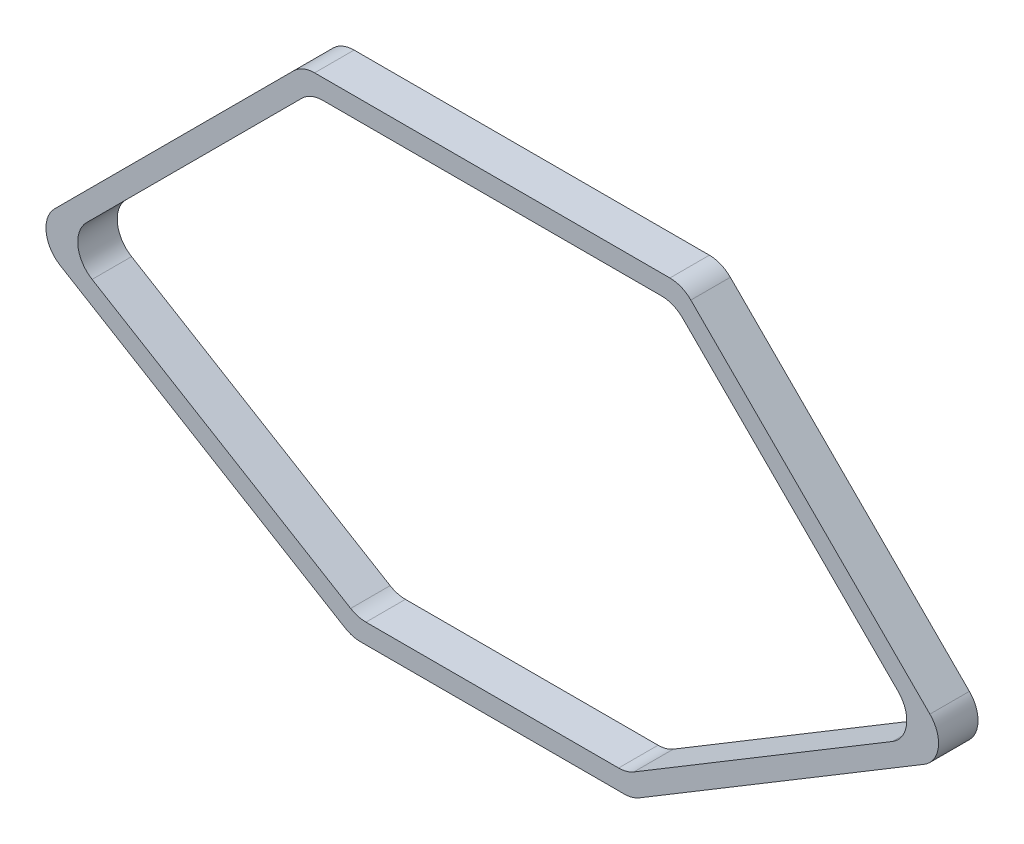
ISO-10303-21;
HEADER;
FILE_DESCRIPTION(('STEP AP214'),'2;1');
FILE_NAME('part.step','',(''),(''),'','','');
FILE_SCHEMA(('AUTOMOTIVE_DESIGN { 1 0 10303 214 1 1 1 1 }'));
ENDSEC;
DATA;
#1=APPLICATION_CONTEXT('core data for automotive mechanical design processes');
#2=APPLICATION_PROTOCOL_DEFINITION('international standard','automotive_design',2000,#1);
#3=PRODUCT_CONTEXT('',#1,'mechanical');
#4=PRODUCT('Part','Part','',(#3));
#5=PRODUCT_RELATED_PRODUCT_CATEGORY('part','',(#4));
#6=PRODUCT_DEFINITION_FORMATION('','',#4);
#7=PRODUCT_DEFINITION_CONTEXT('part definition',#1,'design');
#8=PRODUCT_DEFINITION('design','',#6,#7);
#9=PRODUCT_DEFINITION_SHAPE('','',#8);
#10=(LENGTH_UNIT() NAMED_UNIT(*) SI_UNIT(.MILLI.,.METRE.));
#11=(NAMED_UNIT(*) PLANE_ANGLE_UNIT() SI_UNIT($,.RADIAN.));
#12=(NAMED_UNIT(*) SI_UNIT($,.STERADIAN.) SOLID_ANGLE_UNIT());
#13=UNCERTAINTY_MEASURE_WITH_UNIT(LENGTH_MEASURE(1.E-05),#10,'distance_accuracy_value','');
#14=(GEOMETRIC_REPRESENTATION_CONTEXT(3) GLOBAL_UNCERTAINTY_ASSIGNED_CONTEXT((#13)) GLOBAL_UNIT_ASSIGNED_CONTEXT((#10,
#11,#12)) REPRESENTATION_CONTEXT('',''));
#15=CARTESIAN_POINT('',(0.,0.,0.));
#16=DIRECTION('',(0.,0.,1.));
#17=DIRECTION('',(1.,0.,0.));
#18=AXIS2_PLACEMENT_3D('',#15,#16,#17);
#19=CARTESIAN_POINT('',(-34.7934051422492,-0.469559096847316,1.58750000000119));
#20=DIRECTION('',(0.707106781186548,-0.707106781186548,0.));
#21=DIRECTION('',(0.707106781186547,0.707106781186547,0.));
#22=AXIS2_PLACEMENT_3D('',#19,#20,#21);
#23=PLANE('',#22);
#24=DIRECTION('',(0.707106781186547,0.707106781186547,0.));
#25=VECTOR('',#24,1.);
#26=CARTESIAN_POINT('',(-34.7934051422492,-0.469559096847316,1.58750000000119));
#27=LINE('',#26,#25);
#28=CARTESIAN_POINT('',(-32.6400480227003,1.68379802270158,1.5875000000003));
#29=VERTEX_POINT('',#28);
#30=CARTESIAN_POINT('',(-15.3137339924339,19.0101120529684,1.58750000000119));
#31=VERTEX_POINT('',#30);
#32=EDGE_CURVE('E231',#29,#31,#27,.T.);
#33=ORIENTED_EDGE('',*,*,#32,.F.);
#34=DIRECTION('',(0.,0.,-0.999999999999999));
#35=VECTOR('',#34,1.);
#36=CARTESIAN_POINT('',(-32.6400480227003,1.68379802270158,1.5875000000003));
#37=LINE('',#36,#35);
#38=CARTESIAN_POINT('',(-32.6400480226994,1.68379802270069,-1.58749999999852));
#39=VERTEX_POINT('',#38);
#40=EDGE_CURVE('E308',#29,#39,#37,.T.);
#41=ORIENTED_EDGE('',*,*,#40,.T.);
#42=DIRECTION('',(0.707106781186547,0.707106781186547,0.));
#43=VECTOR('',#42,1.);
#44=CARTESIAN_POINT('',(-34.7934051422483,-0.469559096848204,-1.5875000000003));
#45=LINE('',#44,#43);
#46=CARTESIAN_POINT('',(-15.3137339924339,19.010112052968,-1.5875000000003));
#47=VERTEX_POINT('',#46);
#48=EDGE_CURVE('E235',#39,#47,#45,.T.);
#49=ORIENTED_EDGE('',*,*,#48,.T.);
#50=DIRECTION('',(0.,0.,0.999999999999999));
#51=VECTOR('',#50,1.);
#52=CARTESIAN_POINT('',(-15.3137339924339,19.0101120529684,1.58750000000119));
#53=LINE('',#52,#51);
#54=EDGE_CURVE('E305',#47,#31,#53,.T.);
#55=ORIENTED_EDGE('',*,*,#54,.T.);
#56=EDGE_LOOP('',(#33,#41,#49,#55));
#57=FACE_BOUND('',#56,.T.);
#58=ADVANCED_FACE('F42',(#57),#23,.T.);
#59=CARTESIAN_POINT('',(-37.3515085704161,-0.782598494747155,1.58749999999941));
#60=DIRECTION('',(-0.707106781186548,0.707106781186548,0.));
#61=DIRECTION('',(-0.707106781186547,-0.707106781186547,0.));
#62=AXIS2_PLACEMENT_3D('',#59,#60,#61);
#63=PLANE('',#62);
#64=DIRECTION('',(0.707106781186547,0.707106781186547,0.));
#65=VECTOR('',#64,1.);
#66=CARTESIAN_POINT('',(-37.3515085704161,-0.782598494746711,-1.58749999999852));
#67=LINE('',#66,#65);
#68=CARTESIAN_POINT('',(-35.1981514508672,1.37075862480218,-1.58749999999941));
#69=VERTEX_POINT('',#68);
#70=CARTESIAN_POINT('',(-15.9712980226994,20.5976120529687,-1.5875000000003));
#71=VERTEX_POINT('',#70);
#72=EDGE_CURVE('E224',#69,#71,#67,.T.);
#73=ORIENTED_EDGE('',*,*,#72,.F.);
#74=DIRECTION('',(0.,0.,0.999999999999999));
#75=VECTOR('',#74,1.);
#76=CARTESIAN_POINT('',(-35.1981514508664,1.37075862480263,1.5875000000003));
#77=LINE('',#76,#75);
#78=CARTESIAN_POINT('',(-35.1981514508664,1.37075862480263,1.5875000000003));
#79=VERTEX_POINT('',#78);
#80=EDGE_CURVE('E207',#69,#79,#77,.T.);
#81=ORIENTED_EDGE('',*,*,#80,.T.);
#82=DIRECTION('',(0.707106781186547,0.707106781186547,0.));
#83=VECTOR('',#82,1.);
#84=CARTESIAN_POINT('',(-37.3515085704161,-0.782598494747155,1.58749999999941));
#85=LINE('',#84,#83);
#86=CARTESIAN_POINT('',(-15.9712980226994,20.5976120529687,1.5875000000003));
#87=VERTEX_POINT('',#86);
#88=EDGE_CURVE('E221',#79,#87,#85,.T.);
#89=ORIENTED_EDGE('',*,*,#88,.T.);
#90=DIRECTION('',(0.,0.,-0.999999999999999));
#91=VECTOR('',#90,1.);
#92=CARTESIAN_POINT('',(-15.9712980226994,20.5976120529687,-1.5875000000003));
#93=LINE('',#92,#91);
#94=EDGE_CURVE('E226',#87,#71,#93,.T.);
#95=ORIENTED_EDGE('',*,*,#94,.T.);
#96=EDGE_LOOP('',(#73,#81,#89,#95));
#97=FACE_BOUND('',#96,.T.);
#98=ADVANCED_FACE('F219',(#97),#63,.T.);
#99=CARTESIAN_POINT('',(-10.8214223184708,-14.8999359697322,1.5875000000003));
#100=DIRECTION('',(-0.515735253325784,-0.856748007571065,0.));
#101=DIRECTION('',(0.856748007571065,-0.515735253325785,0.));
#102=AXIS2_PLACEMENT_3D('',#99,#100,#101);
#103=PLANE('',#102);
#104=DIRECTION('',(-0.856748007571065,0.515735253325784,0.));
#105=VECTOR('',#104,1.);
#106=CARTESIAN_POINT('',(-10.8214223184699,-14.8999359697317,-1.58749999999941));
#107=LINE('',#106,#105);
#108=CARTESIAN_POINT('',(-11.3880945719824,-14.5588171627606,-1.58749999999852));
#109=VERTEX_POINT('',#108);
#110=CARTESIAN_POINT('',(-32.1843445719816,-2.04013119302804,-1.58749999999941));
#111=VERTEX_POINT('',#110);
#112=EDGE_CURVE('E377',#109,#111,#107,.T.);
#113=ORIENTED_EDGE('',*,*,#112,.T.);
#114=DIRECTION('',(0.,0.,-0.999999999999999));
#115=VECTOR('',#114,1.);
#116=CARTESIAN_POINT('',(-32.1843445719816,-2.04013119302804,1.5875000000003));
#117=LINE('',#116,#115);
#118=CARTESIAN_POINT('',(-32.1843445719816,-2.04013119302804,1.5875000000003));
#119=VERTEX_POINT('',#118);
#120=EDGE_CURVE('E313',#111,#119,#117,.F.);
#121=ORIENTED_EDGE('',*,*,#120,.T.);
#122=DIRECTION('',(-0.856748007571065,0.515735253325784,0.));
#123=VECTOR('',#122,1.);
#124=CARTESIAN_POINT('',(-10.8214223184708,-14.8999359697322,1.5875000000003));
#125=LINE('',#124,#123);
#126=CARTESIAN_POINT('',(-11.3880945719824,-14.5588171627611,1.5875000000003));
#127=VERTEX_POINT('',#126);
#128=EDGE_CURVE('E374',#127,#119,#125,.T.);
#129=ORIENTED_EDGE('',*,*,#128,.F.);
#130=DIRECTION('',(0.,0.,0.999999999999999));
#131=VECTOR('',#130,1.);
#132=CARTESIAN_POINT('',(-11.3880945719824,-14.5588171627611,1.5875000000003));
#133=LINE('',#132,#131);
#134=EDGE_CURVE('E311',#127,#109,#133,.F.);
#135=ORIENTED_EDGE('',*,*,#134,.T.);
#136=EDGE_LOOP('',(#113,#121,#129,#135));
#137=FACE_BOUND('',#136,.T.);
#138=ADVANCED_FACE('F452',(#137),#103,.F.);
#139=CARTESIAN_POINT('',(-11.2623705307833,-16.4874359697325,1.5875000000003));
#140=DIRECTION('',(0.515735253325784,0.856748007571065,0.));
#141=DIRECTION('',(-0.856748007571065,0.515735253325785,0.));
#142=AXIS2_PLACEMENT_3D('',#139,#140,#141);
#143=PLANE('',#142);
#144=DIRECTION('',(-0.856748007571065,0.515735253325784,0.));
#145=VECTOR('',#144,1.);
#146=CARTESIAN_POINT('',(-11.2623705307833,-16.4874359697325,1.5875000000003));
#147=LINE('',#146,#145);
#148=CARTESIAN_POINT('',(-11.8290427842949,-16.1463171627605,1.58750000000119));
#149=VERTEX_POINT('',#148);
#150=CARTESIAN_POINT('',(-34.7424480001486,-2.35317059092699,1.58749999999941));
#151=VERTEX_POINT('',#150);
#152=EDGE_CURVE('E370',#149,#151,#147,.T.);
#153=ORIENTED_EDGE('',*,*,#152,.T.);
#154=DIRECTION('',(0.,0.,0.999999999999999));
#155=VECTOR('',#154,1.);
#156=CARTESIAN_POINT('',(-34.7424480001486,-2.35317059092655,-1.5875000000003));
#157=LINE('',#156,#155);
#158=CARTESIAN_POINT('',(-34.7424480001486,-2.35317059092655,-1.5875000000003));
#159=VERTEX_POINT('',#158);
#160=EDGE_CURVE('E208',#151,#159,#157,.F.);
#161=ORIENTED_EDGE('',*,*,#160,.T.);
#162=DIRECTION('',(-0.856748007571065,0.515735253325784,0.));
#163=VECTOR('',#162,1.);
#164=CARTESIAN_POINT('',(-11.2623705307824,-16.4874359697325,-1.58749999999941));
#165=LINE('',#164,#163);
#166=CARTESIAN_POINT('',(-11.8290427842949,-16.1463171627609,-1.5875000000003));
#167=VERTEX_POINT('',#166);
#168=EDGE_CURVE('E279',#167,#159,#165,.T.);
#169=ORIENTED_EDGE('',*,*,#168,.F.);
#170=DIRECTION('',(0.,0.,-0.999999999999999));
#171=VECTOR('',#170,1.);
#172=CARTESIAN_POINT('',(-11.8290427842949,-16.1463171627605,1.58750000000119));
#173=LINE('',#172,#171);
#174=EDGE_CURVE('E213',#167,#149,#173,.F.);
#175=ORIENTED_EDGE('',*,*,#174,.T.);
#176=EDGE_LOOP('',(#153,#161,#169,#175));
#177=FACE_BOUND('',#176,.T.);
#178=ADVANCED_FACE('F455',(#177),#143,.F.);
#179=CARTESIAN_POINT('',(10.8214223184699,-14.8999359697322,1.58750000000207));
#180=DIRECTION('',(0.,1.,0.));
#181=DIRECTION('',(0.,0.,0.999999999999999));
#182=AXIS2_PLACEMENT_3D('',#179,#180,#181);
#183=PLANE('',#182);
#184=DIRECTION('',(-1.,0.,0.));
#185=VECTOR('',#184,1.);
#186=CARTESIAN_POINT('',(10.8214223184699,-14.8999359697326,-1.5875000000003));
#187=LINE('',#186,#185);
#188=CARTESIAN_POINT('',(10.1600000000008,-14.8999359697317,-1.58749999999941));
#189=VERTEX_POINT('',#188);
#190=CARTESIAN_POINT('',(-10.1599999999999,-14.8999359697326,-1.5875000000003));
#191=VERTEX_POINT('',#190);
#192=EDGE_CURVE('E380',#189,#191,#187,.T.);
#193=ORIENTED_EDGE('',*,*,#192,.T.);
#194=DIRECTION('',(0.,0.,0.999999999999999));
#195=VECTOR('',#194,1.);
#196=CARTESIAN_POINT('',(-10.1599999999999,-14.8999359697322,1.5875000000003));
#197=LINE('',#196,#195);
#198=CARTESIAN_POINT('',(-10.1599999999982,-14.8999359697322,1.58750000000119));
#199=VERTEX_POINT('',#198);
#200=EDGE_CURVE('E318',#191,#199,#197,.T.);
#201=ORIENTED_EDGE('',*,*,#200,.T.);
#202=DIRECTION('',(-1.,0.,0.));
#203=VECTOR('',#202,1.);
#204=CARTESIAN_POINT('',(10.8214223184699,-14.8999359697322,1.58750000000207));
#205=LINE('',#204,#203);
#206=CARTESIAN_POINT('',(10.1599999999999,-14.8999359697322,1.5875000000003));
#207=VERTEX_POINT('',#206);
#208=EDGE_CURVE('E389',#207,#199,#205,.T.);
#209=ORIENTED_EDGE('',*,*,#208,.F.);
#210=DIRECTION('',(0.,0.,-0.999999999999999));
#211=VECTOR('',#210,1.);
#212=CARTESIAN_POINT('',(10.1599999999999,-14.8999359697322,1.5875000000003));
#213=LINE('',#212,#211);
#214=EDGE_CURVE('E315',#207,#189,#213,.T.);
#215=ORIENTED_EDGE('',*,*,#214,.T.);
#216=EDGE_LOOP('',(#193,#201,#209,#215));
#217=FACE_BOUND('',#216,.T.);
#218=ADVANCED_FACE('F458',(#217),#183,.T.);
#219=CARTESIAN_POINT('',(11.2623705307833,-16.487435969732,1.5875000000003));
#220=DIRECTION('',(0.,-1.,0.));
#221=DIRECTION('',(0.,0.,-0.999999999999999));
#222=AXIS2_PLACEMENT_3D('',#219,#220,#221);
#223=PLANE('',#222);
#224=DIRECTION('',(-1.,0.,0.));
#225=VECTOR('',#224,1.);
#226=CARTESIAN_POINT('',(11.2623705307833,-16.487435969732,1.5875000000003));
#227=LINE('',#226,#225);
#228=CARTESIAN_POINT('',(10.6009482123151,-16.4874359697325,1.58750000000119));
#229=VERTEX_POINT('',#228);
#230=CARTESIAN_POINT('',(-10.6009482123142,-16.4874359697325,1.5875000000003));
#231=VERTEX_POINT('',#230);
#232=EDGE_CURVE('E386',#229,#231,#227,.T.);
#233=ORIENTED_EDGE('',*,*,#232,.T.);
#234=DIRECTION('',(0.,0.,-0.999999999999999));
#235=VECTOR('',#234,1.);
#236=CARTESIAN_POINT('',(-10.6009482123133,-16.4874359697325,-1.58749999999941));
#237=LINE('',#236,#235);
#238=CARTESIAN_POINT('',(-10.6009482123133,-16.4874359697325,-1.58749999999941));
#239=VERTEX_POINT('',#238);
#240=EDGE_CURVE('E298',#231,#239,#237,.T.);
#241=ORIENTED_EDGE('',*,*,#240,.T.);
#242=DIRECTION('',(-1.,0.,0.));
#243=VECTOR('',#242,1.);
#244=CARTESIAN_POINT('',(11.2623705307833,-16.487435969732,-1.5875000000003));
#245=LINE('',#244,#243);
#246=CARTESIAN_POINT('',(10.6009482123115,-16.487435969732,-1.5875000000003));
#247=VERTEX_POINT('',#246);
#248=EDGE_CURVE('E383',#247,#239,#245,.T.);
#249=ORIENTED_EDGE('',*,*,#248,.F.);
#250=DIRECTION('',(0.,0.,0.999999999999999));
#251=VECTOR('',#250,1.);
#252=CARTESIAN_POINT('',(10.6009482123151,-16.4874359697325,1.58750000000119));
#253=LINE('',#252,#251);
#254=EDGE_CURVE('E295',#247,#229,#253,.T.);
#255=ORIENTED_EDGE('',*,*,#254,.T.);
#256=EDGE_LOOP('',(#233,#241,#249,#255));
#257=FACE_BOUND('',#256,.T.);
#258=ADVANCED_FACE('F463',(#257),#223,.T.);
#259=CARTESIAN_POINT('',(34.7934051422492,-0.46955909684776,1.58750000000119));
#260=DIRECTION('',(0.515735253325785,-0.856748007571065,0.));
#261=DIRECTION('',(0.856748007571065,0.515735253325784,0.));
#262=AXIS2_PLACEMENT_3D('',#259,#260,#261);
#263=PLANE('',#262);
#264=DIRECTION('',(-0.856748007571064,-0.515735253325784,0.));
#265=VECTOR('',#264,1.);
#266=CARTESIAN_POINT('',(34.7934051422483,-0.469559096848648,-1.58749999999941));
#267=LINE('',#266,#265);
#268=CARTESIAN_POINT('',(32.1843445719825,-2.04013119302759,-1.58749999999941));
#269=VERTEX_POINT('',#268);
#270=CARTESIAN_POINT('',(11.3880945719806,-14.5588171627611,-1.5875000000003));
#271=VERTEX_POINT('',#270);
#272=EDGE_CURVE('E392',#269,#271,#267,.T.);
#273=ORIENTED_EDGE('',*,*,#272,.T.);
#274=DIRECTION('',(0.,0.,-0.999999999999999));
#275=VECTOR('',#274,1.);
#276=CARTESIAN_POINT('',(11.3880945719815,-14.5588171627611,1.5875000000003));
#277=LINE('',#276,#275);
#278=CARTESIAN_POINT('',(11.3880945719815,-14.5588171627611,1.5875000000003));
#279=VERTEX_POINT('',#278);
#280=EDGE_CURVE('E322',#271,#279,#277,.F.);
#281=ORIENTED_EDGE('',*,*,#280,.T.);
#282=DIRECTION('',(-0.856748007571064,-0.515735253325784,0.));
#283=VECTOR('',#282,1.);
#284=CARTESIAN_POINT('',(34.7934051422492,-0.46955909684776,1.58750000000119));
#285=LINE('',#284,#283);
#286=CARTESIAN_POINT('',(32.1843445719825,-2.04013119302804,1.5875000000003));
#287=VERTEX_POINT('',#286);
#288=EDGE_CURVE('E400',#287,#279,#285,.T.);
#289=ORIENTED_EDGE('',*,*,#288,.F.);
#290=DIRECTION('',(0.,0.,0.999999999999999));
#291=VECTOR('',#290,1.);
#292=CARTESIAN_POINT('',(32.1843445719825,-2.04013119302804,1.5875000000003));
#293=LINE('',#292,#291);
#294=EDGE_CURVE('E64',#287,#269,#293,.F.);
#295=ORIENTED_EDGE('',*,*,#294,.T.);
#296=EDGE_LOOP('',(#273,#281,#289,#295));
#297=FACE_BOUND('',#296,.T.);
#298=ADVANCED_FACE('F466',(#297),#263,.F.);
#299=CARTESIAN_POINT('',(37.3515085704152,-0.782598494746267,1.58750000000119));
#300=DIRECTION('',(-0.515735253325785,0.856748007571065,0.));
#301=DIRECTION('',(-0.856748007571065,-0.515735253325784,0.));
#302=AXIS2_PLACEMENT_3D('',#299,#300,#301);
#303=PLANE('',#302);
#304=DIRECTION('',(-0.856748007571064,-0.515735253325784,0.));
#305=VECTOR('',#304,1.);
#306=CARTESIAN_POINT('',(37.3515085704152,-0.782598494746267,1.58750000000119));
#307=LINE('',#306,#305);
#308=CARTESIAN_POINT('',(34.7424480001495,-2.35317059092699,1.58750000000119));
#309=VERTEX_POINT('',#308);
#310=CARTESIAN_POINT('',(11.8290427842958,-16.1463171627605,1.5875000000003));
#311=VERTEX_POINT('',#310);
#312=EDGE_CURVE('E397',#309,#311,#307,.T.);
#313=ORIENTED_EDGE('',*,*,#312,.T.);
#314=DIRECTION('',(0.,0.,0.999999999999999));
#315=VECTOR('',#314,1.);
#316=CARTESIAN_POINT('',(11.8290427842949,-16.1463171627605,-1.5875000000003));
#317=LINE('',#316,#315);
#318=CARTESIAN_POINT('',(11.8290427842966,-16.1463171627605,-1.58749999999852));
#319=VERTEX_POINT('',#318);
#320=EDGE_CURVE('E303',#311,#319,#317,.F.);
#321=ORIENTED_EDGE('',*,*,#320,.T.);
#322=DIRECTION('',(-0.856748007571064,-0.515735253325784,0.));
#323=VECTOR('',#322,1.);
#324=CARTESIAN_POINT('',(37.3515085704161,-0.782598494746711,-1.5875000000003));
#325=LINE('',#324,#323);
#326=CARTESIAN_POINT('',(34.7424480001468,-2.35317059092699,-1.58749999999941));
#327=VERTEX_POINT('',#326);
#328=EDGE_CURVE('E394',#327,#319,#325,.T.);
#329=ORIENTED_EDGE('',*,*,#328,.F.);
#330=DIRECTION('',(0.,0.,-0.999999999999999));
#331=VECTOR('',#330,1.);
#332=CARTESIAN_POINT('',(34.7424480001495,-2.35317059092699,1.58750000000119));
#333=LINE('',#332,#331);
#334=EDGE_CURVE('E301',#327,#309,#333,.F.);
#335=ORIENTED_EDGE('',*,*,#334,.T.);
#336=EDGE_LOOP('',(#313,#321,#329,#335));
#337=FACE_BOUND('',#336,.T.);
#338=ADVANCED_FACE('F471',(#337),#303,.F.);
#339=CARTESIAN_POINT('',(15.2738460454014,21.2950640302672,1.5875000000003));
#340=DIRECTION('',(0.707106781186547,0.707106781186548,0.));
#341=DIRECTION('',(-0.707106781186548,0.707106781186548,0.));
#342=AXIS2_PLACEMENT_3D('',#339,#340,#341);
#343=PLANE('',#342);
#344=DIRECTION('',(0.707106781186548,-0.707106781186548,0.));
#345=VECTOR('',#344,1.);
#346=CARTESIAN_POINT('',(15.2738460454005,21.2950640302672,-1.58749999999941));
#347=LINE('',#346,#345);
#348=CARTESIAN_POINT('',(15.9712980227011,20.5976120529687,-1.58749999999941));
#349=VERTEX_POINT('',#348);
#350=CARTESIAN_POINT('',(35.1981514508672,1.37075862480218,-1.58749999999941));
#351=VERTEX_POINT('',#350);
#352=EDGE_CURVE('E409',#349,#351,#347,.T.);
#353=ORIENTED_EDGE('',*,*,#352,.F.);
#354=DIRECTION('',(0.,0.,0.999999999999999));
#355=VECTOR('',#354,1.);
#356=CARTESIAN_POINT('',(15.9712980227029,20.5976120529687,1.5875000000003));
#357=LINE('',#356,#355);
#358=CARTESIAN_POINT('',(15.9712980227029,20.5976120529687,1.5875000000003));
#359=VERTEX_POINT('',#358);
#360=EDGE_CURVE('E292',#349,#359,#357,.T.);
#361=ORIENTED_EDGE('',*,*,#360,.T.);
#362=DIRECTION('',(0.707106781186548,-0.707106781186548,0.));
#363=VECTOR('',#362,1.);
#364=CARTESIAN_POINT('',(15.2738460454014,21.2950640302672,1.5875000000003));
#365=LINE('',#364,#363);
#366=CARTESIAN_POINT('',(35.1981514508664,1.37075862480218,1.58750000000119));
#367=VERTEX_POINT('',#366);
#368=EDGE_CURVE('E247',#359,#367,#365,.T.);
#369=ORIENTED_EDGE('',*,*,#368,.T.);
#370=DIRECTION('',(0.,0.,-0.999999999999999));
#371=VECTOR('',#370,1.);
#372=CARTESIAN_POINT('',(35.1981514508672,1.37075862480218,-1.58749999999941));
#373=LINE('',#372,#371);
#374=EDGE_CURVE('E289',#367,#351,#373,.T.);
#375=ORIENTED_EDGE('',*,*,#374,.T.);
#376=EDGE_LOOP('',(#353,#361,#369,#375));
#377=FACE_BOUND('',#376,.T.);
#378=ADVANCED_FACE('F417',(#377),#343,.T.);
#379=CARTESIAN_POINT('',(14.6162820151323,19.7075640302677,1.5875000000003));
#380=DIRECTION('',(-0.707106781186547,-0.707106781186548,0.));
#381=DIRECTION('',(0.707106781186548,-0.707106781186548,0.));
#382=AXIS2_PLACEMENT_3D('',#379,#380,#381);
#383=PLANE('',#382);
#384=DIRECTION('',(0.707106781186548,-0.707106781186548,0.));
#385=VECTOR('',#384,1.);
#386=CARTESIAN_POINT('',(14.6162820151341,19.7075640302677,-1.58749999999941));
#387=LINE('',#386,#385);
#388=CARTESIAN_POINT('',(15.313733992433,19.0101120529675,-1.5875000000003));
#389=VERTEX_POINT('',#388);
#390=CARTESIAN_POINT('',(32.6400480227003,1.68379802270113,-1.5875000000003));
#391=VERTEX_POINT('',#390);
#392=EDGE_CURVE('E406',#389,#391,#387,.T.);
#393=ORIENTED_EDGE('',*,*,#392,.T.);
#394=DIRECTION('',(0.,0.,0.999999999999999));
#395=VECTOR('',#394,1.);
#396=CARTESIAN_POINT('',(32.6400480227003,1.68379802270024,1.5875000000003));
#397=LINE('',#396,#395);
#398=CARTESIAN_POINT('',(32.6400480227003,1.68379802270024,1.5875000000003));
#399=VERTEX_POINT('',#398);
#400=EDGE_CURVE('E327',#391,#399,#397,.T.);
#401=ORIENTED_EDGE('',*,*,#400,.T.);
#402=DIRECTION('',(0.707106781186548,-0.707106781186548,0.));
#403=VECTOR('',#402,1.);
#404=CARTESIAN_POINT('',(14.6162820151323,19.7075640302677,1.5875000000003));
#405=LINE('',#404,#403);
#406=CARTESIAN_POINT('',(15.313733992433,19.0101120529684,1.58750000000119));
#407=VERTEX_POINT('',#406);
#408=EDGE_CURVE('E403',#407,#399,#405,.T.);
#409=ORIENTED_EDGE('',*,*,#408,.F.);
#410=DIRECTION('',(0.,0.,-0.999999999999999));
#411=VECTOR('',#410,1.);
#412=CARTESIAN_POINT('',(15.313733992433,19.0101120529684,1.58750000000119));
#413=LINE('',#412,#411);
#414=EDGE_CURVE('E324',#407,#389,#413,.T.);
#415=ORIENTED_EDGE('',*,*,#414,.T.);
#416=EDGE_LOOP('',(#393,#401,#409,#415));
#417=FACE_BOUND('',#416,.T.);
#418=ADVANCED_FACE('F477',(#417),#383,.T.);
#419=CARTESIAN_POINT('',(22.0445798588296,21.295064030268,1.5875000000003));
#420=DIRECTION('',(0.,0.,-0.999999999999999));
#421=DIRECTION('',(0.,1.,0.));
#422=AXIS2_PLACEMENT_3D('',#419,#420,#421);
#423=PLANE('',#422);
#424=DIRECTION('',(-1.,0.,0.));
#425=VECTOR('',#424,1.);
#426=CARTESIAN_POINT('',(22.0445798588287,19.7075640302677,1.5875000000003));
#427=LINE('',#426,#425);
#428=CARTESIAN_POINT('',(13.6299359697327,19.7075640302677,1.5875000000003));
#429=VERTEX_POINT('',#428);
#430=CARTESIAN_POINT('',(-13.6299359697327,19.7075640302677,1.58750000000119));
#431=VERTEX_POINT('',#430);
#432=EDGE_CURVE('E248',#429,#431,#427,.T.);
#433=ORIENTED_EDGE('',*,*,#432,.F.);
#434=CARTESIAN_POINT('',(13.6299359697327,17.3263140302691,1.58750000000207));
#435=DIRECTION('',(0.,0.,-0.999999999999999));
#436=DIRECTION('',(0.,1.,0.));
#437=AXIS2_PLACEMENT_3D('',#434,#435,#436);
#438=CIRCLE('',#437,2.38125);
#439=EDGE_CURVE('E351',#429,#407,#438,.T.);
#440=ORIENTED_EDGE('',*,*,#439,.T.);
#441=ORIENTED_EDGE('',*,*,#408,.T.);
#442=CARTESIAN_POINT('',(30.9562500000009,1.77635683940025E-12,1.58750000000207));
#443=DIRECTION('',(0.,0.,-0.999999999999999));
#444=DIRECTION('',(0.,1.,0.));
#445=AXIS2_PLACEMENT_3D('',#442,#443,#444);
#446=CIRCLE('',#445,2.38125);
#447=EDGE_CURVE('E345',#399,#287,#446,.T.);
#448=ORIENTED_EDGE('',*,*,#447,.T.);
#449=ORIENTED_EDGE('',*,*,#288,.T.);
#450=CARTESIAN_POINT('',(10.1599999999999,-12.5186859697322,1.58750000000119));
#451=DIRECTION('',(0.,0.,-0.999999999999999));
#452=DIRECTION('',(0.,1.,0.));
#453=AXIS2_PLACEMENT_3D('',#450,#451,#452);
#454=CIRCLE('',#453,2.38125);
#455=EDGE_CURVE('E343',#279,#207,#454,.T.);
#456=ORIENTED_EDGE('',*,*,#455,.T.);
#457=ORIENTED_EDGE('',*,*,#208,.T.);
#458=CARTESIAN_POINT('',(-10.1599999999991,-12.5186859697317,1.58749999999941));
#459=DIRECTION('',(0.,0.,-0.999999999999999));
#460=DIRECTION('',(0.,1.,0.));
#461=AXIS2_PLACEMENT_3D('',#458,#459,#460);
#462=CIRCLE('',#461,2.38125);
#463=EDGE_CURVE('E338',#199,#127,#462,.T.);
#464=ORIENTED_EDGE('',*,*,#463,.T.);
#465=ORIENTED_EDGE('',*,*,#128,.T.);
#466=CARTESIAN_POINT('',(-30.9562499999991,8.88178419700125E-13,1.58750000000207));
#467=DIRECTION('',(0.,0.,-0.999999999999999));
#468=DIRECTION('',(0.,1.,0.));
#469=AXIS2_PLACEMENT_3D('',#466,#467,#468);
#470=CIRCLE('',#469,2.38125);
#471=EDGE_CURVE('E336',#119,#29,#470,.T.);
#472=ORIENTED_EDGE('',*,*,#471,.T.);
#473=ORIENTED_EDGE('',*,*,#32,.T.);
#474=CARTESIAN_POINT('',(-13.6299359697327,17.3263140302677,1.5875000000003));
#475=DIRECTION('',(0.,0.,-0.999999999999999));
#476=DIRECTION('',(0.,1.,0.));
#477=AXIS2_PLACEMENT_3D('',#474,#475,#476);
#478=CIRCLE('',#477,2.38125);
#479=EDGE_CURVE('E50',#31,#431,#478,.T.);
#480=ORIENTED_EDGE('',*,*,#479,.T.);
#481=EDGE_LOOP('',(#433,#440,#441,#448,#449,#456,#457,#464,#465,#472,#473,#480));
#482=FACE_BOUND('',#481,.T.);
#483=ORIENTED_EDGE('',*,*,#88,.F.);
#484=CARTESIAN_POINT('',(-33.5143534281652,-0.313039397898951,1.5875000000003));
#485=DIRECTION('',(0.,0.,-0.999999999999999));
#486=DIRECTION('',(0.,1.,0.));
#487=AXIS2_PLACEMENT_3D('',#484,#485,#486);
#488=CIRCLE('',#487,2.38125);
#489=EDGE_CURVE('E203',#79,#151,#488,.F.);
#490=ORIENTED_EDGE('',*,*,#489,.T.);
#491=ORIENTED_EDGE('',*,*,#152,.F.);
#492=CARTESIAN_POINT('',(-10.6009482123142,-14.106185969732,1.5875000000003));
#493=DIRECTION('',(0.,0.,-0.999999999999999));
#494=DIRECTION('',(0.,1.,0.));
#495=AXIS2_PLACEMENT_3D('',#492,#493,#494);
#496=CIRCLE('',#495,2.38125);
#497=EDGE_CURVE('E252',#149,#231,#496,.F.);
#498=ORIENTED_EDGE('',*,*,#497,.T.);
#499=ORIENTED_EDGE('',*,*,#232,.F.);
#500=CARTESIAN_POINT('',(10.6009482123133,-14.1061859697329,1.58749999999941));
#501=DIRECTION('',(0.,0.,-0.999999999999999));
#502=DIRECTION('',(0.,1.,0.));
#503=AXIS2_PLACEMENT_3D('',#500,#501,#502);
#504=CIRCLE('',#503,2.38125);
#505=EDGE_CURVE('E250',#229,#311,#504,.F.);
#506=ORIENTED_EDGE('',*,*,#505,.T.);
#507=ORIENTED_EDGE('',*,*,#312,.F.);
#508=CARTESIAN_POINT('',(33.5143534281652,-0.313039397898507,1.5875000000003));
#509=DIRECTION('',(0.,0.,-0.999999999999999));
#510=DIRECTION('',(0.,1.,0.));
#511=AXIS2_PLACEMENT_3D('',#508,#509,#510);
#512=CIRCLE('',#511,2.38125);
#513=EDGE_CURVE('E225',#309,#367,#512,.F.);
#514=ORIENTED_EDGE('',*,*,#513,.T.);
#515=ORIENTED_EDGE('',*,*,#368,.F.);
#516=CARTESIAN_POINT('',(14.2875,18.9138140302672,1.5875000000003));
#517=DIRECTION('',(0.,0.,-0.999999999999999));
#518=DIRECTION('',(0.,1.,0.));
#519=AXIS2_PLACEMENT_3D('',#516,#517,#518);
#520=CIRCLE('',#519,2.38125);
#521=CARTESIAN_POINT('',(14.2875,21.2950640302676,1.5875000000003));
#522=VERTEX_POINT('',#521);
#523=EDGE_CURVE('E254',#359,#522,#520,.F.);
#524=ORIENTED_EDGE('',*,*,#523,.T.);
#525=DIRECTION('',(-1.,0.,0.));
#526=VECTOR('',#525,1.);
#527=CARTESIAN_POINT('',(22.0445798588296,21.295064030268,1.5875000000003));
#528=LINE('',#527,#526);
#529=CARTESIAN_POINT('',(-14.2875,21.295064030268,1.5875000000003));
#530=VERTEX_POINT('',#529);
#531=EDGE_CURVE('E244',#522,#530,#528,.T.);
#532=ORIENTED_EDGE('',*,*,#531,.T.);
#533=CARTESIAN_POINT('',(-14.2875,18.9138140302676,1.58750000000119));
#534=DIRECTION('',(0.,0.,-0.999999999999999));
#535=DIRECTION('',(0.,1.,0.));
#536=AXIS2_PLACEMENT_3D('',#533,#534,#535);
#537=CIRCLE('',#536,2.38125);
#538=EDGE_CURVE('E214',#530,#87,#537,.F.);
#539=ORIENTED_EDGE('',*,*,#538,.T.);
#540=EDGE_LOOP('',(#483,#490,#491,#498,#499,#506,#507,#514,#515,#524,#532,#539));
#541=FACE_BOUND('',#540,.T.);
#542=ADVANCED_FACE('F228',(#482,#541),#423,.F.);
#543=CARTESIAN_POINT('',(22.0445798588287,19.7075640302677,1.5875000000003));
#544=DIRECTION('',(0.,1.,0.));
#545=DIRECTION('',(0.,0.,0.999999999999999));
#546=AXIS2_PLACEMENT_3D('',#543,#544,#545);
#547=PLANE('',#546);
#548=DIRECTION('',(-1.,0.,0.));
#549=VECTOR('',#548,1.);
#550=CARTESIAN_POINT('',(22.0445798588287,19.7075640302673,-1.58749999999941));
#551=LINE('',#550,#549);
#552=CARTESIAN_POINT('',(13.6299359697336,19.7075640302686,-1.58749999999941));
#553=VERTEX_POINT('',#552);
#554=CARTESIAN_POINT('',(-13.6299359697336,19.7075640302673,-1.5875000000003));
#555=VERTEX_POINT('',#554);
#556=EDGE_CURVE('E263',#553,#555,#551,.T.);
#557=ORIENTED_EDGE('',*,*,#556,.F.);
#558=DIRECTION('',(0.,0.,-0.999999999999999));
#559=VECTOR('',#558,1.);
#560=CARTESIAN_POINT('',(13.6299359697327,19.7075640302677,1.5875000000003));
#561=LINE('',#560,#559);
#562=EDGE_CURVE('E332',#553,#429,#561,.F.);
#563=ORIENTED_EDGE('',*,*,#562,.T.);
#564=ORIENTED_EDGE('',*,*,#432,.T.);
#565=DIRECTION('',(0.,0.,0.999999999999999));
#566=VECTOR('',#565,1.);
#567=CARTESIAN_POINT('',(-13.6299359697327,19.7075640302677,1.58750000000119));
#568=LINE('',#567,#566);
#569=EDGE_CURVE('E330',#431,#555,#568,.F.);
#570=ORIENTED_EDGE('',*,*,#569,.T.);
#571=EDGE_LOOP('',(#557,#563,#564,#570));
#572=FACE_BOUND('',#571,.T.);
#573=ADVANCED_FACE('F362',(#572),#547,.F.);
#574=CARTESIAN_POINT('',(22.0445798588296,21.2950640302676,-1.58749999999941));
#575=DIRECTION('',(0.,0.,0.999999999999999));
#576=DIRECTION('',(0.,-1.,0.));
#577=AXIS2_PLACEMENT_3D('',#574,#575,#576);
#578=PLANE('',#577);
#579=ORIENTED_EDGE('',*,*,#168,.T.);
#580=CARTESIAN_POINT('',(-33.5143534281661,-0.313039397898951,-1.58749999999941));
#581=DIRECTION('',(0.,0.,0.999999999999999));
#582=DIRECTION('',(0.,-1.,0.));
#583=AXIS2_PLACEMENT_3D('',#580,#581,#582);
#584=CIRCLE('',#583,2.38125);
#585=EDGE_CURVE('E277',#159,#69,#584,.F.);
#586=ORIENTED_EDGE('',*,*,#585,.T.);
#587=ORIENTED_EDGE('',*,*,#72,.T.);
#588=CARTESIAN_POINT('',(-14.2874999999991,18.9138140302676,-1.58749999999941));
#589=DIRECTION('',(0.,0.,0.999999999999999));
#590=DIRECTION('',(0.,-1.,0.));
#591=AXIS2_PLACEMENT_3D('',#588,#589,#590);
#592=CIRCLE('',#591,2.38125);
#593=CARTESIAN_POINT('',(-14.2875,21.2950640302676,-1.58749999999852));
#594=VERTEX_POINT('',#593);
#595=EDGE_CURVE('E276',#71,#594,#592,.F.);
#596=ORIENTED_EDGE('',*,*,#595,.T.);
#597=DIRECTION('',(-1.,0.,0.));
#598=VECTOR('',#597,1.);
#599=CARTESIAN_POINT('',(22.0445798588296,21.2950640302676,-1.58749999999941));
#600=LINE('',#599,#598);
#601=CARTESIAN_POINT('',(14.2875,21.2950640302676,-1.58749999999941));
#602=VERTEX_POINT('',#601);
#603=EDGE_CURVE('E260',#602,#594,#600,.T.);
#604=ORIENTED_EDGE('',*,*,#603,.F.);
#605=CARTESIAN_POINT('',(14.2874999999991,18.9138140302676,-1.58749999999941));
#606=DIRECTION('',(0.,0.,0.999999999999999));
#607=DIRECTION('',(0.,-1.,0.));
#608=AXIS2_PLACEMENT_3D('',#605,#606,#607);
#609=CIRCLE('',#608,2.38125);
#610=EDGE_CURVE('E284',#602,#349,#609,.F.);
#611=ORIENTED_EDGE('',*,*,#610,.T.);
#612=ORIENTED_EDGE('',*,*,#352,.T.);
#613=CARTESIAN_POINT('',(33.5143534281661,-0.313039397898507,-1.58749999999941));
#614=DIRECTION('',(0.,0.,0.999999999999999));
#615=DIRECTION('',(0.,-1.,0.));
#616=AXIS2_PLACEMENT_3D('',#613,#614,#615);
#617=CIRCLE('',#616,2.38125);
#618=EDGE_CURVE('E259',#351,#327,#617,.F.);
#619=ORIENTED_EDGE('',*,*,#618,.T.);
#620=ORIENTED_EDGE('',*,*,#328,.T.);
#621=CARTESIAN_POINT('',(10.6009482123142,-14.106185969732,-1.58749999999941));
#622=DIRECTION('',(0.,0.,0.999999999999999));
#623=DIRECTION('',(0.,-1.,0.));
#624=AXIS2_PLACEMENT_3D('',#621,#622,#623);
#625=CIRCLE('',#624,2.38125);
#626=EDGE_CURVE('E424',#319,#247,#625,.F.);
#627=ORIENTED_EDGE('',*,*,#626,.T.);
#628=ORIENTED_EDGE('',*,*,#248,.T.);
#629=CARTESIAN_POINT('',(-10.6009482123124,-14.106185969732,-1.58749999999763));
#630=DIRECTION('',(0.,0.,0.999999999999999));
#631=DIRECTION('',(0.,-1.,0.));
#632=AXIS2_PLACEMENT_3D('',#629,#630,#631);
#633=CIRCLE('',#632,2.38125);
#634=EDGE_CURVE('E425',#239,#167,#633,.F.);
#635=ORIENTED_EDGE('',*,*,#634,.T.);
#636=EDGE_LOOP('',(#579,#586,#587,#596,#604,#611,#612,#619,#620,#627,#628,#635));
#637=FACE_BOUND('',#636,.T.);
#638=ORIENTED_EDGE('',*,*,#392,.F.);
#639=CARTESIAN_POINT('',(13.6299359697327,17.3263140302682,-1.58749999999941));
#640=DIRECTION('',(0.,0.,0.999999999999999));
#641=DIRECTION('',(0.,-1.,0.));
#642=AXIS2_PLACEMENT_3D('',#639,#640,#641);
#643=CIRCLE('',#642,2.38125);
#644=EDGE_CURVE('E349',#389,#553,#643,.T.);
#645=ORIENTED_EDGE('',*,*,#644,.T.);
#646=ORIENTED_EDGE('',*,*,#556,.T.);
#647=CARTESIAN_POINT('',(-13.6299359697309,17.3263140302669,-1.58749999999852));
#648=DIRECTION('',(0.,0.,0.999999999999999));
#649=DIRECTION('',(0.,-1.,0.));
#650=AXIS2_PLACEMENT_3D('',#647,#648,#649);
#651=CIRCLE('',#650,2.38125);
#652=EDGE_CURVE('E12',#555,#47,#651,.T.);
#653=ORIENTED_EDGE('',*,*,#652,.T.);
#654=ORIENTED_EDGE('',*,*,#48,.F.);
#655=CARTESIAN_POINT('',(-30.95625,4.44089209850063E-13,-1.5875000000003));
#656=DIRECTION('',(0.,0.,0.999999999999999));
#657=DIRECTION('',(0.,-1.,0.));
#658=AXIS2_PLACEMENT_3D('',#655,#656,#657);
#659=CIRCLE('',#658,2.38125);
#660=EDGE_CURVE('E334',#39,#111,#659,.T.);
#661=ORIENTED_EDGE('',*,*,#660,.T.);
#662=ORIENTED_EDGE('',*,*,#112,.F.);
#663=CARTESIAN_POINT('',(-10.1599999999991,-12.5186859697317,-1.58749999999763));
#664=DIRECTION('',(0.,0.,0.999999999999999));
#665=DIRECTION('',(0.,-1.,0.));
#666=AXIS2_PLACEMENT_3D('',#663,#664,#665);
#667=CIRCLE('',#666,2.38125);
#668=EDGE_CURVE('E340',#109,#191,#667,.T.);
#669=ORIENTED_EDGE('',*,*,#668,.T.);
#670=ORIENTED_EDGE('',*,*,#192,.F.);
#671=CARTESIAN_POINT('',(10.1599999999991,-12.5186859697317,-1.5875000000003));
#672=DIRECTION('',(0.,0.,0.999999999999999));
#673=DIRECTION('',(0.,-1.,0.));
#674=AXIS2_PLACEMENT_3D('',#671,#672,#673);
#675=CIRCLE('',#674,2.38125);
#676=EDGE_CURVE('E57',#189,#271,#675,.T.);
#677=ORIENTED_EDGE('',*,*,#676,.T.);
#678=ORIENTED_EDGE('',*,*,#272,.F.);
#679=CARTESIAN_POINT('',(30.95625,0.,-1.5875000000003));
#680=DIRECTION('',(0.,0.,0.999999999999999));
#681=DIRECTION('',(0.,-1.,0.));
#682=AXIS2_PLACEMENT_3D('',#679,#680,#681);
#683=CIRCLE('',#682,2.38125);
#684=EDGE_CURVE('E347',#269,#391,#683,.T.);
#685=ORIENTED_EDGE('',*,*,#684,.T.);
#686=EDGE_LOOP('',(#638,#645,#646,#653,#654,#661,#662,#669,#670,#677,#678,#685));
#687=FACE_BOUND('',#686,.T.);
#688=ADVANCED_FACE('F274',(#637,#687),#578,.F.);
#689=CARTESIAN_POINT('',(22.0445798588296,21.295064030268,1.5875000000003));
#690=DIRECTION('',(0.,-1.,0.));
#691=DIRECTION('',(0.,0.,-0.999999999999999));
#692=AXIS2_PLACEMENT_3D('',#689,#690,#691);
#693=PLANE('',#692);
#694=ORIENTED_EDGE('',*,*,#603,.T.);
#695=DIRECTION('',(0.,0.,-0.999999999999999));
#696=VECTOR('',#695,1.);
#697=CARTESIAN_POINT('',(-14.2875,21.295064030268,1.5875000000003));
#698=LINE('',#697,#696);
#699=EDGE_CURVE('E282',#594,#530,#698,.F.);
#700=ORIENTED_EDGE('',*,*,#699,.T.);
#701=ORIENTED_EDGE('',*,*,#531,.F.);
#702=DIRECTION('',(0.,0.,0.999999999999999));
#703=VECTOR('',#702,1.);
#704=CARTESIAN_POINT('',(14.2875,21.2950640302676,-1.58749999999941));
#705=LINE('',#704,#703);
#706=EDGE_CURVE('E280',#522,#602,#705,.F.);
#707=ORIENTED_EDGE('',*,*,#706,.T.);
#708=EDGE_LOOP('',(#694,#700,#701,#707));
#709=FACE_BOUND('',#708,.T.);
#710=ADVANCED_FACE('F435',(#709),#693,.F.);
#711=CARTESIAN_POINT('',(-33.5143534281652,-0.313039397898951,1.5875000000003));
#712=DIRECTION('',(0.,0.,-0.999999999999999));
#713=DIRECTION('',(-1.,0.,0.));
#714=AXIS2_PLACEMENT_3D('',#711,#712,#713);
#715=CYLINDRICAL_SURFACE('',#714,2.38125);
#716=ORIENTED_EDGE('',*,*,#585,.F.);
#717=ORIENTED_EDGE('',*,*,#160,.F.);
#718=ORIENTED_EDGE('',*,*,#489,.F.);
#719=ORIENTED_EDGE('',*,*,#80,.F.);
#720=EDGE_LOOP('',(#716,#717,#718,#719));
#721=FACE_BOUND('',#720,.T.);
#722=ADVANCED_FACE('F206',(#721),#715,.T.);
#723=CARTESIAN_POINT('',(-14.2875,18.9138140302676,1.58750000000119));
#724=DIRECTION('',(0.,0.,0.999999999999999));
#725=DIRECTION('',(1.,0.,0.));
#726=AXIS2_PLACEMENT_3D('',#723,#724,#725);
#727=CYLINDRICAL_SURFACE('',#726,2.38125);
#728=ORIENTED_EDGE('',*,*,#538,.F.);
#729=ORIENTED_EDGE('',*,*,#699,.F.);
#730=ORIENTED_EDGE('',*,*,#595,.F.);
#731=ORIENTED_EDGE('',*,*,#94,.F.);
#732=EDGE_LOOP('',(#728,#729,#730,#731));
#733=FACE_BOUND('',#732,.T.);
#734=ADVANCED_FACE('F437',(#733),#727,.T.);
#735=CARTESIAN_POINT('',(14.2875,18.9138140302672,1.5875000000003));
#736=DIRECTION('',(0.,0.,-0.999999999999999));
#737=DIRECTION('',(-1.,0.,0.));
#738=AXIS2_PLACEMENT_3D('',#735,#736,#737);
#739=CYLINDRICAL_SURFACE('',#738,2.38125);
#740=ORIENTED_EDGE('',*,*,#610,.F.);
#741=ORIENTED_EDGE('',*,*,#706,.F.);
#742=ORIENTED_EDGE('',*,*,#523,.F.);
#743=ORIENTED_EDGE('',*,*,#360,.F.);
#744=EDGE_LOOP('',(#740,#741,#742,#743));
#745=FACE_BOUND('',#744,.T.);
#746=ADVANCED_FACE('F432',(#745),#739,.T.);
#747=CARTESIAN_POINT('',(-10.6009482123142,-14.106185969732,1.5875000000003));
#748=DIRECTION('',(0.,0.,0.999999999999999));
#749=DIRECTION('',(1.,0.,0.));
#750=AXIS2_PLACEMENT_3D('',#747,#748,#749);
#751=CYLINDRICAL_SURFACE('',#750,2.38125);
#752=ORIENTED_EDGE('',*,*,#497,.F.);
#753=ORIENTED_EDGE('',*,*,#174,.F.);
#754=ORIENTED_EDGE('',*,*,#634,.F.);
#755=ORIENTED_EDGE('',*,*,#240,.F.);
#756=EDGE_LOOP('',(#752,#753,#754,#755));
#757=FACE_BOUND('',#756,.T.);
#758=ADVANCED_FACE('F444',(#757),#751,.T.);
#759=CARTESIAN_POINT('',(10.6009482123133,-14.1061859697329,1.58749999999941));
#760=DIRECTION('',(0.,0.,-0.999999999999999));
#761=DIRECTION('',(-1.,0.,0.));
#762=AXIS2_PLACEMENT_3D('',#759,#760,#761);
#763=CYLINDRICAL_SURFACE('',#762,2.38125);
#764=ORIENTED_EDGE('',*,*,#626,.F.);
#765=ORIENTED_EDGE('',*,*,#320,.F.);
#766=ORIENTED_EDGE('',*,*,#505,.F.);
#767=ORIENTED_EDGE('',*,*,#254,.F.);
#768=EDGE_LOOP('',(#764,#765,#766,#767));
#769=FACE_BOUND('',#768,.T.);
#770=ADVANCED_FACE('F521',(#769),#763,.T.);
#771=CARTESIAN_POINT('',(33.5143534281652,-0.313039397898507,1.5875000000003));
#772=DIRECTION('',(0.,0.,0.999999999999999));
#773=DIRECTION('',(1.,0.,0.));
#774=AXIS2_PLACEMENT_3D('',#771,#772,#773);
#775=CYLINDRICAL_SURFACE('',#774,2.38125);
#776=ORIENTED_EDGE('',*,*,#513,.F.);
#777=ORIENTED_EDGE('',*,*,#334,.F.);
#778=ORIENTED_EDGE('',*,*,#618,.F.);
#779=ORIENTED_EDGE('',*,*,#374,.F.);
#780=EDGE_LOOP('',(#776,#777,#778,#779));
#781=FACE_BOUND('',#780,.T.);
#782=ADVANCED_FACE('F421',(#781),#775,.T.);
#783=CARTESIAN_POINT('',(-30.9562499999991,8.88178419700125E-13,1.58750000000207));
#784=DIRECTION('',(0.,0.,-0.999999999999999));
#785=DIRECTION('',(-1.,0.,0.));
#786=AXIS2_PLACEMENT_3D('',#783,#784,#785);
#787=CYLINDRICAL_SURFACE('',#786,2.38125);
#788=ORIENTED_EDGE('',*,*,#471,.F.);
#789=ORIENTED_EDGE('',*,*,#120,.F.);
#790=ORIENTED_EDGE('',*,*,#660,.F.);
#791=ORIENTED_EDGE('',*,*,#40,.F.);
#792=EDGE_LOOP('',(#788,#789,#790,#791));
#793=FACE_BOUND('',#792,.T.);
#794=ADVANCED_FACE('F540',(#793),#787,.F.);
#795=CARTESIAN_POINT('',(-10.1599999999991,-12.5186859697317,1.58749999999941));
#796=DIRECTION('',(0.,0.,0.999999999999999));
#797=DIRECTION('',(1.,0.,0.));
#798=AXIS2_PLACEMENT_3D('',#795,#796,#797);
#799=CYLINDRICAL_SURFACE('',#798,2.38125);
#800=ORIENTED_EDGE('',*,*,#668,.F.);
#801=ORIENTED_EDGE('',*,*,#134,.F.);
#802=ORIENTED_EDGE('',*,*,#463,.F.);
#803=ORIENTED_EDGE('',*,*,#200,.F.);
#804=EDGE_LOOP('',(#800,#801,#802,#803));
#805=FACE_BOUND('',#804,.T.);
#806=ADVANCED_FACE('F549',(#805),#799,.F.);
#807=CARTESIAN_POINT('',(10.1599999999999,-12.5186859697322,1.58750000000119));
#808=DIRECTION('',(0.,0.,-0.999999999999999));
#809=DIRECTION('',(-1.,0.,0.));
#810=AXIS2_PLACEMENT_3D('',#807,#808,#809);
#811=CYLINDRICAL_SURFACE('',#810,2.38125);
#812=ORIENTED_EDGE('',*,*,#455,.F.);
#813=ORIENTED_EDGE('',*,*,#280,.F.);
#814=ORIENTED_EDGE('',*,*,#676,.F.);
#815=ORIENTED_EDGE('',*,*,#214,.F.);
#816=EDGE_LOOP('',(#812,#813,#814,#815));
#817=FACE_BOUND('',#816,.T.);
#818=ADVANCED_FACE('F559',(#817),#811,.F.);
#819=CARTESIAN_POINT('',(30.9562500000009,1.77635683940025E-12,1.58750000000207));
#820=DIRECTION('',(0.,0.,0.999999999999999));
#821=DIRECTION('',(1.,0.,0.));
#822=AXIS2_PLACEMENT_3D('',#819,#820,#821);
#823=CYLINDRICAL_SURFACE('',#822,2.38125);
#824=ORIENTED_EDGE('',*,*,#684,.F.);
#825=ORIENTED_EDGE('',*,*,#294,.F.);
#826=ORIENTED_EDGE('',*,*,#447,.F.);
#827=ORIENTED_EDGE('',*,*,#400,.F.);
#828=EDGE_LOOP('',(#824,#825,#826,#827));
#829=FACE_BOUND('',#828,.T.);
#830=ADVANCED_FACE('F569',(#829),#823,.F.);
#831=CARTESIAN_POINT('',(13.6299359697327,17.3263140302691,1.58750000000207));
#832=DIRECTION('',(0.,0.,-0.999999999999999));
#833=DIRECTION('',(-1.,0.,0.));
#834=AXIS2_PLACEMENT_3D('',#831,#832,#833);
#835=CYLINDRICAL_SURFACE('',#834,2.38125);
#836=ORIENTED_EDGE('',*,*,#439,.F.);
#837=ORIENTED_EDGE('',*,*,#562,.F.);
#838=ORIENTED_EDGE('',*,*,#644,.F.);
#839=ORIENTED_EDGE('',*,*,#414,.F.);
#840=EDGE_LOOP('',(#836,#837,#838,#839));
#841=FACE_BOUND('',#840,.T.);
#842=ADVANCED_FACE('F579',(#841),#835,.F.);
#843=CARTESIAN_POINT('',(-13.6299359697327,17.3263140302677,1.5875000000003));
#844=DIRECTION('',(0.,0.,0.999999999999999));
#845=DIRECTION('',(1.,0.,0.));
#846=AXIS2_PLACEMENT_3D('',#843,#844,#845);
#847=CYLINDRICAL_SURFACE('',#846,2.38125);
#848=ORIENTED_EDGE('',*,*,#652,.F.);
#849=ORIENTED_EDGE('',*,*,#569,.F.);
#850=ORIENTED_EDGE('',*,*,#479,.F.);
#851=ORIENTED_EDGE('',*,*,#54,.F.);
#852=EDGE_LOOP('',(#848,#849,#850,#851));
#853=FACE_BOUND('',#852,.T.);
#854=ADVANCED_FACE('F44',(#853),#847,.F.);
#855=CLOSED_SHELL('',(#58,#98,#138,#178,#218,#258,#298,#338,#378,#418,#542,#573,#688,#710,#722,
#734,#746,#758,#770,#782,#794,#806,#818,#830,#842,#854));
#856=MANIFOLD_SOLID_BREP('B2',#855);
#857=ADVANCED_BREP_SHAPE_REPRESENTATION('',(#18,#856),#14);
#858=SHAPE_DEFINITION_REPRESENTATION(#9,#857);
ENDSEC;
END-ISO-10303-21;
